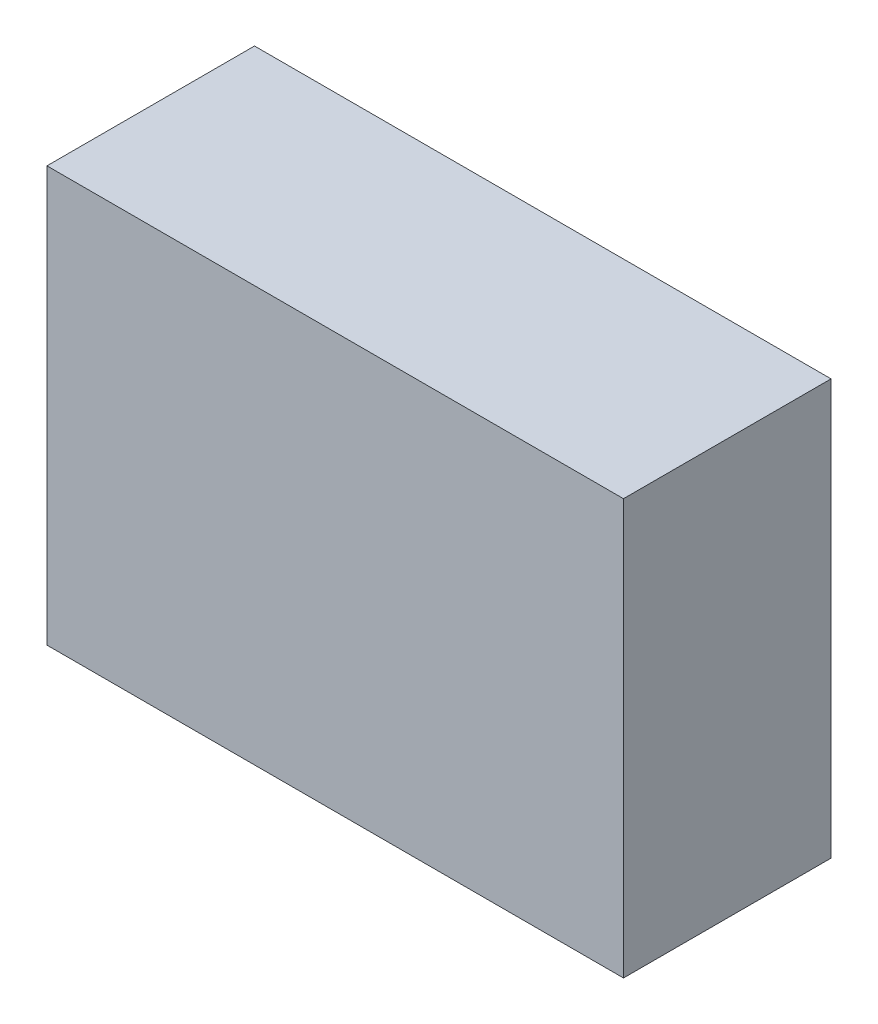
ISO-10303-21;
HEADER;
FILE_DESCRIPTION(('STEP AP214'),'2;1');
FILE_NAME('part.step','',(''),(''),'','','');
FILE_SCHEMA(('AUTOMOTIVE_DESIGN { 1 0 10303 214 1 1 1 1 }'));
ENDSEC;
DATA;
#1=APPLICATION_CONTEXT('core data for automotive mechanical design processes');
#2=APPLICATION_PROTOCOL_DEFINITION('international standard','automotive_design',2000,#1);
#3=PRODUCT_CONTEXT('',#1,'mechanical');
#4=PRODUCT('Part','Part','',(#3));
#5=PRODUCT_RELATED_PRODUCT_CATEGORY('part','',(#4));
#6=PRODUCT_DEFINITION_FORMATION('','',#4);
#7=PRODUCT_DEFINITION_CONTEXT('part definition',#1,'design');
#8=PRODUCT_DEFINITION('design','',#6,#7);
#9=PRODUCT_DEFINITION_SHAPE('','',#8);
#10=(LENGTH_UNIT() NAMED_UNIT(*) SI_UNIT(.MILLI.,.METRE.));
#11=(NAMED_UNIT(*) PLANE_ANGLE_UNIT() SI_UNIT($,.RADIAN.));
#12=(NAMED_UNIT(*) SI_UNIT($,.STERADIAN.) SOLID_ANGLE_UNIT());
#13=UNCERTAINTY_MEASURE_WITH_UNIT(LENGTH_MEASURE(1.E-05),#10,'distance_accuracy_value','');
#14=(GEOMETRIC_REPRESENTATION_CONTEXT(3) GLOBAL_UNCERTAINTY_ASSIGNED_CONTEXT((#13)) GLOBAL_UNIT_ASSIGNED_CONTEXT((#10,
#11,#12)) REPRESENTATION_CONTEXT('',''));
#15=CARTESIAN_POINT('',(0.,0.,0.));
#16=DIRECTION('',(0.,0.,1.));
#17=DIRECTION('',(1.,0.,0.));
#18=AXIS2_PLACEMENT_3D('',#15,#16,#17);
#19=CARTESIAN_POINT('',(0.,0.,4.5));
#20=DIRECTION('',(0.,0.,1.));
#21=DIRECTION('',(1.,0.,0.));
#22=AXIS2_PLACEMENT_3D('',#19,#20,#21);
#23=PLANE('',#22);
#24=DIRECTION('',(-1.,0.,0.));
#25=VECTOR('',#24,1.);
#26=CARTESIAN_POINT('',(0.,-9.,4.5));
#27=LINE('',#26,#25);
#28=CARTESIAN_POINT('',(12.5,-9.,4.5));
#29=VERTEX_POINT('',#28);
#30=CARTESIAN_POINT('',(-12.5,-9.,4.5));
#31=VERTEX_POINT('',#30);
#32=EDGE_CURVE('E11',#29,#31,#27,.T.);
#33=ORIENTED_EDGE('',*,*,#32,.F.);
#34=DIRECTION('',(0.,-1.,0.));
#35=VECTOR('',#34,1.);
#36=CARTESIAN_POINT('',(12.5,0.,4.5));
#37=LINE('',#36,#35);
#38=CARTESIAN_POINT('',(12.5,9.,4.5));
#39=VERTEX_POINT('',#38);
#40=EDGE_CURVE('E61',#39,#29,#37,.T.);
#41=ORIENTED_EDGE('',*,*,#40,.F.);
#42=DIRECTION('',(1.,0.,0.));
#43=VECTOR('',#42,1.);
#44=CARTESIAN_POINT('',(0.,9.,4.5));
#45=LINE('',#44,#43);
#46=CARTESIAN_POINT('',(-12.5,9.,4.5));
#47=VERTEX_POINT('',#46);
#48=EDGE_CURVE('E87',#47,#39,#45,.T.);
#49=ORIENTED_EDGE('',*,*,#48,.F.);
#50=DIRECTION('',(0.,1.,0.));
#51=VECTOR('',#50,1.);
#52=CARTESIAN_POINT('',(-12.5,0.,4.5));
#53=LINE('',#52,#51);
#54=EDGE_CURVE('E24',#31,#47,#53,.T.);
#55=ORIENTED_EDGE('',*,*,#54,.F.);
#56=EDGE_LOOP('',(#33,#41,#49,#55));
#57=FACE_BOUND('',#56,.T.);
#58=ADVANCED_FACE('F17',(#57),#23,.T.);
#59=CARTESIAN_POINT('',(0.,-9.,-4.5));
#60=DIRECTION('',(0.,-1.,0.));
#61=DIRECTION('',(0.,0.,-1.));
#62=AXIS2_PLACEMENT_3D('',#59,#60,#61);
#63=PLANE('',#62);
#64=DIRECTION('',(0.,0.,1.));
#65=VECTOR('',#64,1.);
#66=CARTESIAN_POINT('',(12.5,-9.,-4.5));
#67=LINE('',#66,#65);
#68=CARTESIAN_POINT('',(12.5,-9.,-4.5));
#69=VERTEX_POINT('',#68);
#70=EDGE_CURVE('E53',#69,#29,#67,.T.);
#71=ORIENTED_EDGE('',*,*,#70,.T.);
#72=ORIENTED_EDGE('',*,*,#32,.T.);
#73=DIRECTION('',(0.,0.,1.));
#74=VECTOR('',#73,1.);
#75=CARTESIAN_POINT('',(-12.5,-9.,-4.5));
#76=LINE('',#75,#74);
#77=CARTESIAN_POINT('',(-12.5,-9.,-4.5));
#78=VERTEX_POINT('',#77);
#79=EDGE_CURVE('E70',#78,#31,#76,.T.);
#80=ORIENTED_EDGE('',*,*,#79,.F.);
#81=DIRECTION('',(1.,0.,0.));
#82=VECTOR('',#81,1.);
#83=CARTESIAN_POINT('',(0.,-9.,-4.5));
#84=LINE('',#83,#82);
#85=EDGE_CURVE('E65',#78,#69,#84,.T.);
#86=ORIENTED_EDGE('',*,*,#85,.T.);
#87=EDGE_LOOP('',(#71,#72,#80,#86));
#88=FACE_BOUND('',#87,.T.);
#89=ADVANCED_FACE('F66',(#88),#63,.T.);
#90=CARTESIAN_POINT('',(-12.5,0.,-4.5));
#91=DIRECTION('',(-1.,0.,0.));
#92=DIRECTION('',(0.,0.,1.));
#93=AXIS2_PLACEMENT_3D('',#90,#91,#92);
#94=PLANE('',#93);
#95=ORIENTED_EDGE('',*,*,#79,.T.);
#96=ORIENTED_EDGE('',*,*,#54,.T.);
#97=DIRECTION('',(0.,0.,1.));
#98=VECTOR('',#97,1.);
#99=CARTESIAN_POINT('',(-12.5,9.,-4.5));
#100=LINE('',#99,#98);
#101=CARTESIAN_POINT('',(-12.5,9.,-4.5));
#102=VERTEX_POINT('',#101);
#103=EDGE_CURVE('E85',#102,#47,#100,.T.);
#104=ORIENTED_EDGE('',*,*,#103,.F.);
#105=DIRECTION('',(0.,-1.,0.));
#106=VECTOR('',#105,1.);
#107=CARTESIAN_POINT('',(-12.5,0.,-4.5));
#108=LINE('',#107,#106);
#109=EDGE_CURVE('E75',#102,#78,#108,.T.);
#110=ORIENTED_EDGE('',*,*,#109,.T.);
#111=EDGE_LOOP('',(#95,#96,#104,#110));
#112=FACE_BOUND('',#111,.T.);
#113=ADVANCED_FACE('F93',(#112),#94,.T.);
#114=CARTESIAN_POINT('',(0.,9.,-4.5));
#115=DIRECTION('',(0.,1.,0.));
#116=DIRECTION('',(0.,0.,1.));
#117=AXIS2_PLACEMENT_3D('',#114,#115,#116);
#118=PLANE('',#117);
#119=ORIENTED_EDGE('',*,*,#103,.T.);
#120=ORIENTED_EDGE('',*,*,#48,.T.);
#121=DIRECTION('',(0.,0.,1.));
#122=VECTOR('',#121,1.);
#123=CARTESIAN_POINT('',(12.5,9.,-4.5));
#124=LINE('',#123,#122);
#125=CARTESIAN_POINT('',(12.5,9.,-4.5));
#126=VERTEX_POINT('',#125);
#127=EDGE_CURVE('E62',#126,#39,#124,.T.);
#128=ORIENTED_EDGE('',*,*,#127,.F.);
#129=DIRECTION('',(-1.,0.,0.));
#130=VECTOR('',#129,1.);
#131=CARTESIAN_POINT('',(0.,9.,-4.5));
#132=LINE('',#131,#130);
#133=EDGE_CURVE('E76',#126,#102,#132,.T.);
#134=ORIENTED_EDGE('',*,*,#133,.T.);
#135=EDGE_LOOP('',(#119,#120,#128,#134));
#136=FACE_BOUND('',#135,.T.);
#137=ADVANCED_FACE('F90',(#136),#118,.T.);
#138=CARTESIAN_POINT('',(0.,0.,-4.5));
#139=DIRECTION('',(0.,0.,-1.));
#140=DIRECTION('',(-1.,0.,0.));
#141=AXIS2_PLACEMENT_3D('',#138,#139,#140);
#142=PLANE('',#141);
#143=DIRECTION('',(0.,1.,0.));
#144=VECTOR('',#143,1.);
#145=CARTESIAN_POINT('',(12.5,0.,-4.5));
#146=LINE('',#145,#144);
#147=EDGE_CURVE('E56',#69,#126,#146,.T.);
#148=ORIENTED_EDGE('',*,*,#147,.F.);
#149=ORIENTED_EDGE('',*,*,#85,.F.);
#150=ORIENTED_EDGE('',*,*,#109,.F.);
#151=ORIENTED_EDGE('',*,*,#133,.F.);
#152=EDGE_LOOP('',(#148,#149,#150,#151));
#153=FACE_BOUND('',#152,.T.);
#154=ADVANCED_FACE('F72',(#153),#142,.T.);
#155=CARTESIAN_POINT('',(12.5,0.,-4.5));
#156=DIRECTION('',(1.,0.,0.));
#157=DIRECTION('',(0.,0.,-1.));
#158=AXIS2_PLACEMENT_3D('',#155,#156,#157);
#159=PLANE('',#158);
#160=ORIENTED_EDGE('',*,*,#147,.T.);
#161=ORIENTED_EDGE('',*,*,#127,.T.);
#162=ORIENTED_EDGE('',*,*,#40,.T.);
#163=ORIENTED_EDGE('',*,*,#70,.F.);
#164=EDGE_LOOP('',(#160,#161,#162,#163));
#165=FACE_BOUND('',#164,.T.);
#166=ADVANCED_FACE('F57',(#165),#159,.T.);
#167=CLOSED_SHELL('',(#58,#89,#113,#137,#154,#166));
#168=MANIFOLD_SOLID_BREP('B1',#167);
#169=ADVANCED_BREP_SHAPE_REPRESENTATION('',(#18,#168),#14);
#170=SHAPE_DEFINITION_REPRESENTATION(#9,#169);
ENDSEC;
END-ISO-10303-21;
